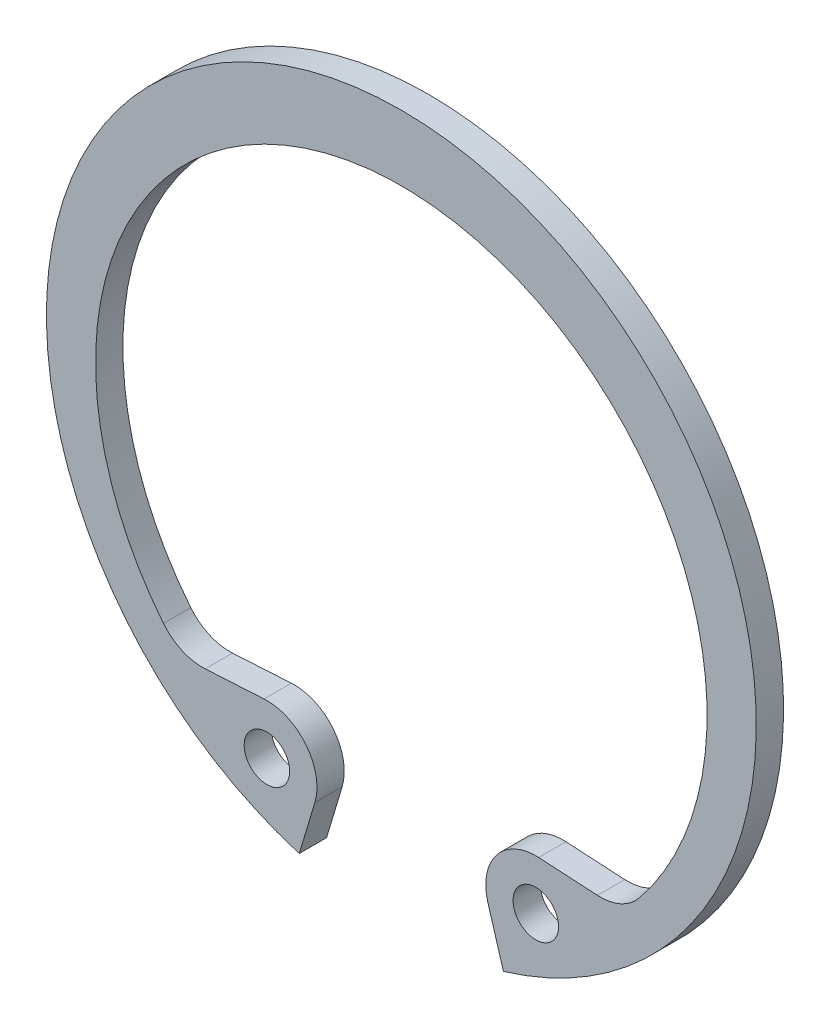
ISO-10303-21;
HEADER;
FILE_DESCRIPTION(('STEP AP214'),'2;1');
FILE_NAME('part.step','',(''),(''),'','','');
FILE_SCHEMA(('AUTOMOTIVE_DESIGN { 1 0 10303 214 1 1 1 1 }'));
ENDSEC;
DATA;
#1=APPLICATION_CONTEXT('core data for automotive mechanical design processes');
#2=APPLICATION_PROTOCOL_DEFINITION('international standard','automotive_design',2000,#1);
#3=PRODUCT_CONTEXT('',#1,'mechanical');
#4=PRODUCT('Part','Part','',(#3));
#5=PRODUCT_RELATED_PRODUCT_CATEGORY('part','',(#4));
#6=PRODUCT_DEFINITION_FORMATION('','',#4);
#7=PRODUCT_DEFINITION_CONTEXT('part definition',#1,'design');
#8=PRODUCT_DEFINITION('design','',#6,#7);
#9=PRODUCT_DEFINITION_SHAPE('','',#8);
#10=(LENGTH_UNIT() NAMED_UNIT(*) SI_UNIT(.MILLI.,.METRE.));
#11=(NAMED_UNIT(*) PLANE_ANGLE_UNIT() SI_UNIT($,.RADIAN.));
#12=(NAMED_UNIT(*) SI_UNIT($,.STERADIAN.) SOLID_ANGLE_UNIT());
#13=UNCERTAINTY_MEASURE_WITH_UNIT(LENGTH_MEASURE(1.E-05),#10,'distance_accuracy_value','');
#14=(GEOMETRIC_REPRESENTATION_CONTEXT(3) GLOBAL_UNCERTAINTY_ASSIGNED_CONTEXT((#13)) GLOBAL_UNIT_ASSIGNED_CONTEXT((#10,
#11,#12)) REPRESENTATION_CONTEXT('',''));
#15=CARTESIAN_POINT('',(0.,0.,0.));
#16=DIRECTION('',(0.,0.,1.));
#17=DIRECTION('',(1.,0.,0.));
#18=AXIS2_PLACEMENT_3D('',#15,#16,#17);
#19=CARTESIAN_POINT('',(0.,0.,1.5));
#20=DIRECTION('',(0.,0.,1.));
#21=DIRECTION('',(1.00000000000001,0.,0.));
#22=AXIS2_PLACEMENT_3D('',#19,#20,#21);
#23=PLANE('',#22);
#24=CARTESIAN_POINT('',(7.38669661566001,-15.0332702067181,1.5));
#25=DIRECTION('',(0.,0.,1.));
#26=DIRECTION('',(1.00000000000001,0.,0.));
#27=AXIS2_PLACEMENT_3D('',#24,#25,#26);
#28=CIRCLE('',#27,1.25);
#29=CARTESIAN_POINT('',(8.63669661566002,-15.0332702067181,1.5));
#30=VERTEX_POINT('',#29);
#31=EDGE_CURVE('E127',#30,#30,#28,.T.);
#32=ORIENTED_EDGE('',*,*,#31,.F.);
#33=EDGE_LOOP('',(#32));
#34=FACE_BOUND('',#33,.T.);
#35=CARTESIAN_POINT('',(0.,0.,1.5));
#36=DIRECTION('',(0.,0.,1.));
#37=DIRECTION('',(1.00000000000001,0.,0.));
#38=AXIS2_PLACEMENT_3D('',#35,#36,#37);
#39=CIRCLE('',#38,19.5);
#40=CARTESIAN_POINT('',(5.60938086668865,-18.6757823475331,1.5));
#41=VERTEX_POINT('',#40);
#42=CARTESIAN_POINT('',(-5.60938086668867,-18.6757823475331,1.5));
#43=VERTEX_POINT('',#42);
#44=EDGE_CURVE('E149',#41,#43,#39,.T.);
#45=ORIENTED_EDGE('',*,*,#44,.T.);
#46=DIRECTION('',(0.287660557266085,0.957732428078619,0.));
#47=VECTOR('',#46,1.);
#48=CARTESIAN_POINT('',(-4.75293243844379,-15.8243367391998,1.5));
#49=LINE('',#48,#47);
#50=CARTESIAN_POINT('',(-4.75293243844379,-15.8243367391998,1.5));
#51=VERTEX_POINT('',#50);
#52=EDGE_CURVE('E122',#43,#51,#49,.T.);
#53=ORIENTED_EDGE('',*,*,#52,.T.);
#54=CARTESIAN_POINT('',(-7.38669661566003,-15.0332702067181,1.5));
#55=DIRECTION('',(0.,0.,1.));
#56=DIRECTION('',(-1.00000000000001,0.,0.));
#57=AXIS2_PLACEMENT_3D('',#54,#55,#56);
#58=CIRCLE('',#57,2.75);
#59=CARTESIAN_POINT('',(-7.54413763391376,-12.2877807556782,1.5));
#60=VERTEX_POINT('',#59);
#61=EDGE_CURVE('E152',#51,#60,#58,.T.);
#62=ORIENTED_EDGE('',*,*,#61,.T.);
#63=DIRECTION('',(-0.998359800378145,-0.057251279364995,0.));
#64=VECTOR('',#63,1.);
#65=CARTESIAN_POINT('',(-10.7731774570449,-12.4729511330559,1.5));
#66=LINE('',#65,#64);
#67=CARTESIAN_POINT('',(-10.7731774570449,-12.4729511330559,1.5));
#68=VERTEX_POINT('',#67);
#69=EDGE_CURVE('E154',#60,#68,#66,.T.);
#70=ORIENTED_EDGE('',*,*,#69,.T.);
#71=CARTESIAN_POINT('',(-10.9306184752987,-9.72746168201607,1.5));
#72=DIRECTION('',(0.,0.,-1.));
#73=DIRECTION('',(-1.00000000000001,0.,0.));
#74=AXIS2_PLACEMENT_3D('',#71,#72,#73);
#75=CIRCLE('',#74,2.75);
#76=CARTESIAN_POINT('',(-13.0700633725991,-11.455256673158,1.5));
#77=VERTEX_POINT('',#76);
#78=EDGE_CURVE('E156',#68,#77,#75,.T.);
#79=ORIENTED_EDGE('',*,*,#78,.T.);
#80=CARTESIAN_POINT('',(0.,-0.899999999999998,1.5));
#81=DIRECTION('',(0.,0.,-1.));
#82=DIRECTION('',(1.00000000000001,0.,0.));
#83=AXIS2_PLACEMENT_3D('',#80,#81,#82);
#84=CIRCLE('',#83,16.8);
#85=CARTESIAN_POINT('',(13.0700633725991,-11.455256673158,1.5));
#86=VERTEX_POINT('',#85);
#87=EDGE_CURVE('E158',#77,#86,#84,.T.);
#88=ORIENTED_EDGE('',*,*,#87,.T.);
#89=CARTESIAN_POINT('',(10.9306184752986,-9.72746168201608,1.5));
#90=DIRECTION('',(0.,0.,-1.));
#91=DIRECTION('',(1.00000000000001,0.,0.));
#92=AXIS2_PLACEMENT_3D('',#89,#90,#91);
#93=CIRCLE('',#92,2.75);
#94=CARTESIAN_POINT('',(10.7731774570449,-12.472951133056,1.5));
#95=VERTEX_POINT('',#94);
#96=EDGE_CURVE('E160',#86,#95,#93,.T.);
#97=ORIENTED_EDGE('',*,*,#96,.T.);
#98=DIRECTION('',(-0.998359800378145,0.0572512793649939,0.));
#99=VECTOR('',#98,1.);
#100=CARTESIAN_POINT('',(10.7731774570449,-12.472951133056,1.5));
#101=LINE('',#100,#99);
#102=CARTESIAN_POINT('',(7.54413763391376,-12.2877807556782,1.5));
#103=VERTEX_POINT('',#102);
#104=EDGE_CURVE('E162',#95,#103,#101,.T.);
#105=ORIENTED_EDGE('',*,*,#104,.T.);
#106=CARTESIAN_POINT('',(7.38669661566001,-15.0332702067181,1.5));
#107=DIRECTION('',(0.,0.,1.));
#108=DIRECTION('',(1.00000000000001,0.,0.));
#109=AXIS2_PLACEMENT_3D('',#106,#107,#108);
#110=CIRCLE('',#109,2.75);
#111=CARTESIAN_POINT('',(4.75293243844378,-15.8243367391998,1.5));
#112=VERTEX_POINT('',#111);
#113=EDGE_CURVE('E51',#103,#112,#110,.T.);
#114=ORIENTED_EDGE('',*,*,#113,.T.);
#115=DIRECTION('',(0.287660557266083,-0.957732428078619,0.));
#116=VECTOR('',#115,1.);
#117=CARTESIAN_POINT('',(4.75293243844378,-15.8243367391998,1.5));
#118=LINE('',#117,#116);
#119=EDGE_CURVE('E46',#112,#41,#118,.T.);
#120=ORIENTED_EDGE('',*,*,#119,.T.);
#121=EDGE_LOOP('',(#45,#53,#62,#70,#79,#88,#97,#105,#114,#120));
#122=FACE_BOUND('',#121,.T.);
#123=CARTESIAN_POINT('',(-7.38669661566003,-15.0332702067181,1.5));
#124=DIRECTION('',(0.,0.,1.));
#125=DIRECTION('',(-1.00000000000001,0.,0.));
#126=AXIS2_PLACEMENT_3D('',#123,#124,#125);
#127=CIRCLE('',#126,1.25);
#128=CARTESIAN_POINT('',(-8.63669661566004,-15.0332702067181,1.5));
#129=VERTEX_POINT('',#128);
#130=EDGE_CURVE('E249',#129,#129,#127,.T.);
#131=ORIENTED_EDGE('',*,*,#130,.F.);
#132=EDGE_LOOP('',(#131));
#133=FACE_BOUND('',#132,.T.);
#134=ADVANCED_FACE('F31',(#34,#122,#133),#23,.T.);
#135=CARTESIAN_POINT('',(0.,0.,0.));
#136=DIRECTION('',(0.,0.,1.));
#137=DIRECTION('',(1.00000000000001,0.,0.));
#138=AXIS2_PLACEMENT_3D('',#135,#136,#137);
#139=PLANE('',#138);
#140=CARTESIAN_POINT('',(7.38669661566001,-15.0332702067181,0.));
#141=DIRECTION('',(0.,0.,1.));
#142=DIRECTION('',(1.00000000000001,0.,0.));
#143=AXIS2_PLACEMENT_3D('',#140,#141,#142);
#144=CIRCLE('',#143,1.25);
#145=CARTESIAN_POINT('',(8.63669661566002,-15.0332702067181,0.));
#146=VERTEX_POINT('',#145);
#147=EDGE_CURVE('E130',#146,#146,#144,.T.);
#148=ORIENTED_EDGE('',*,*,#147,.T.);
#149=EDGE_LOOP('',(#148));
#150=FACE_BOUND('',#149,.T.);
#151=CARTESIAN_POINT('',(0.,0.,0.));
#152=DIRECTION('',(0.,0.,1.));
#153=DIRECTION('',(1.00000000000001,0.,0.));
#154=AXIS2_PLACEMENT_3D('',#151,#152,#153);
#155=CIRCLE('',#154,19.5);
#156=CARTESIAN_POINT('',(5.60938086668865,-18.6757823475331,0.));
#157=VERTEX_POINT('',#156);
#158=CARTESIAN_POINT('',(-5.60938086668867,-18.6757823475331,0.));
#159=VERTEX_POINT('',#158);
#160=EDGE_CURVE('E113',#157,#159,#155,.T.);
#161=ORIENTED_EDGE('',*,*,#160,.F.);
#162=DIRECTION('',(0.287660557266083,-0.957732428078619,0.));
#163=VECTOR('',#162,1.);
#164=CARTESIAN_POINT('',(4.75293243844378,-15.8243367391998,0.));
#165=LINE('',#164,#163);
#166=CARTESIAN_POINT('',(4.75293243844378,-15.8243367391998,0.));
#167=VERTEX_POINT('',#166);
#168=EDGE_CURVE('E147',#167,#157,#165,.T.);
#169=ORIENTED_EDGE('',*,*,#168,.F.);
#170=CARTESIAN_POINT('',(7.38669661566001,-15.0332702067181,0.));
#171=DIRECTION('',(0.,0.,1.));
#172=DIRECTION('',(1.00000000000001,0.,0.));
#173=AXIS2_PLACEMENT_3D('',#170,#171,#172);
#174=CIRCLE('',#173,2.75);
#175=CARTESIAN_POINT('',(7.54413763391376,-12.2877807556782,0.));
#176=VERTEX_POINT('',#175);
#177=EDGE_CURVE('E145',#176,#167,#174,.T.);
#178=ORIENTED_EDGE('',*,*,#177,.F.);
#179=DIRECTION('',(-0.998359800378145,0.0572512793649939,0.));
#180=VECTOR('',#179,1.);
#181=CARTESIAN_POINT('',(10.7731774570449,-12.472951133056,0.));
#182=LINE('',#181,#180);
#183=CARTESIAN_POINT('',(10.7731774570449,-12.472951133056,0.));
#184=VERTEX_POINT('',#183);
#185=EDGE_CURVE('E143',#184,#176,#182,.T.);
#186=ORIENTED_EDGE('',*,*,#185,.F.);
#187=CARTESIAN_POINT('',(10.9306184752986,-9.72746168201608,0.));
#188=DIRECTION('',(0.,0.,-1.));
#189=DIRECTION('',(1.00000000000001,0.,0.));
#190=AXIS2_PLACEMENT_3D('',#187,#188,#189);
#191=CIRCLE('',#190,2.75);
#192=CARTESIAN_POINT('',(13.0700633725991,-11.455256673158,0.));
#193=VERTEX_POINT('',#192);
#194=EDGE_CURVE('E141',#193,#184,#191,.T.);
#195=ORIENTED_EDGE('',*,*,#194,.F.);
#196=CARTESIAN_POINT('',(0.,-0.899999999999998,0.));
#197=DIRECTION('',(0.,0.,-1.));
#198=DIRECTION('',(1.00000000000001,0.,0.));
#199=AXIS2_PLACEMENT_3D('',#196,#197,#198);
#200=CIRCLE('',#199,16.8);
#201=CARTESIAN_POINT('',(-13.0700633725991,-11.455256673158,0.));
#202=VERTEX_POINT('',#201);
#203=EDGE_CURVE('E139',#202,#193,#200,.T.);
#204=ORIENTED_EDGE('',*,*,#203,.F.);
#205=CARTESIAN_POINT('',(-10.9306184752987,-9.72746168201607,0.));
#206=DIRECTION('',(0.,0.,-1.));
#207=DIRECTION('',(-1.00000000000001,0.,0.));
#208=AXIS2_PLACEMENT_3D('',#205,#206,#207);
#209=CIRCLE('',#208,2.75);
#210=CARTESIAN_POINT('',(-10.7731774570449,-12.4729511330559,0.));
#211=VERTEX_POINT('',#210);
#212=EDGE_CURVE('E137',#211,#202,#209,.T.);
#213=ORIENTED_EDGE('',*,*,#212,.F.);
#214=DIRECTION('',(-0.998359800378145,-0.057251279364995,0.));
#215=VECTOR('',#214,1.);
#216=CARTESIAN_POINT('',(-10.7731774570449,-12.4729511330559,0.));
#217=LINE('',#216,#215);
#218=CARTESIAN_POINT('',(-7.54413763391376,-12.2877807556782,0.));
#219=VERTEX_POINT('',#218);
#220=EDGE_CURVE('E135',#219,#211,#217,.T.);
#221=ORIENTED_EDGE('',*,*,#220,.F.);
#222=CARTESIAN_POINT('',(-7.38669661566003,-15.0332702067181,0.));
#223=DIRECTION('',(0.,0.,1.));
#224=DIRECTION('',(-1.00000000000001,0.,0.));
#225=AXIS2_PLACEMENT_3D('',#222,#223,#224);
#226=CIRCLE('',#225,2.75);
#227=CARTESIAN_POINT('',(-4.75293243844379,-15.8243367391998,0.));
#228=VERTEX_POINT('',#227);
#229=EDGE_CURVE('E115',#228,#219,#226,.T.);
#230=ORIENTED_EDGE('',*,*,#229,.F.);
#231=DIRECTION('',(0.287660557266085,0.957732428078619,0.));
#232=VECTOR('',#231,1.);
#233=CARTESIAN_POINT('',(-4.75293243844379,-15.8243367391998,0.));
#234=LINE('',#233,#232);
#235=EDGE_CURVE('E108',#159,#228,#234,.T.);
#236=ORIENTED_EDGE('',*,*,#235,.F.);
#237=EDGE_LOOP('',(#161,#169,#178,#186,#195,#204,#213,#221,#230,#236));
#238=FACE_BOUND('',#237,.T.);
#239=CARTESIAN_POINT('',(-7.38669661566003,-15.0332702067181,0.));
#240=DIRECTION('',(0.,0.,1.));
#241=DIRECTION('',(-1.00000000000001,0.,0.));
#242=AXIS2_PLACEMENT_3D('',#239,#240,#241);
#243=CIRCLE('',#242,1.25);
#244=CARTESIAN_POINT('',(-8.63669661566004,-15.0332702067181,0.));
#245=VERTEX_POINT('',#244);
#246=EDGE_CURVE('E252',#245,#245,#243,.T.);
#247=ORIENTED_EDGE('',*,*,#246,.T.);
#248=EDGE_LOOP('',(#247));
#249=FACE_BOUND('',#248,.T.);
#250=ADVANCED_FACE('F109',(#150,#238,#249),#139,.F.);
#251=CARTESIAN_POINT('',(0.,0.,1.5));
#252=DIRECTION('',(0.,0.,-1.));
#253=DIRECTION('',(-1.00000000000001,0.,0.));
#254=AXIS2_PLACEMENT_3D('',#251,#252,#253);
#255=CYLINDRICAL_SURFACE('',#254,19.5);
#256=ORIENTED_EDGE('',*,*,#160,.T.);
#257=DIRECTION('',(0.,0.,-1.));
#258=VECTOR('',#257,1.);
#259=CARTESIAN_POINT('',(-5.60938086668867,-18.6757823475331,1.5));
#260=LINE('',#259,#258);
#261=EDGE_CURVE('E11',#43,#159,#260,.T.);
#262=ORIENTED_EDGE('',*,*,#261,.F.);
#263=ORIENTED_EDGE('',*,*,#44,.F.);
#264=DIRECTION('',(0.,0.,-1.));
#265=VECTOR('',#264,1.);
#266=CARTESIAN_POINT('',(5.60938086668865,-18.6757823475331,1.5));
#267=LINE('',#266,#265);
#268=EDGE_CURVE('E126',#41,#157,#267,.T.);
#269=ORIENTED_EDGE('',*,*,#268,.T.);
#270=EDGE_LOOP('',(#256,#262,#263,#269));
#271=FACE_BOUND('',#270,.T.);
#272=ADVANCED_FACE('F33',(#271),#255,.T.);
#273=CARTESIAN_POINT('',(-4.75293243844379,-15.8243367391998,1.5));
#274=DIRECTION('',(-0.957732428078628,0.287660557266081,0.));
#275=DIRECTION('',(-0.287660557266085,-0.957732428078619,0.));
#276=AXIS2_PLACEMENT_3D('',#273,#274,#275);
#277=PLANE('',#276);
#278=ORIENTED_EDGE('',*,*,#235,.T.);
#279=DIRECTION('',(0.,0.,-1.));
#280=VECTOR('',#279,1.);
#281=CARTESIAN_POINT('',(-4.75293243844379,-15.8243367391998,1.5));
#282=LINE('',#281,#280);
#283=EDGE_CURVE('E39',#51,#228,#282,.T.);
#284=ORIENTED_EDGE('',*,*,#283,.F.);
#285=ORIENTED_EDGE('',*,*,#52,.F.);
#286=ORIENTED_EDGE('',*,*,#261,.T.);
#287=EDGE_LOOP('',(#278,#284,#285,#286));
#288=FACE_BOUND('',#287,.T.);
#289=ADVANCED_FACE('F121',(#288),#277,.F.);
#290=CARTESIAN_POINT('',(-7.38669661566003,-15.0332702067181,1.5));
#291=DIRECTION('',(0.,0.,-1.));
#292=DIRECTION('',(-1.00000000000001,0.,0.));
#293=AXIS2_PLACEMENT_3D('',#290,#291,#292);
#294=CYLINDRICAL_SURFACE('',#293,2.75);
#295=ORIENTED_EDGE('',*,*,#229,.T.);
#296=DIRECTION('',(0.,0.,-1.));
#297=VECTOR('',#296,1.);
#298=CARTESIAN_POINT('',(-7.54413763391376,-12.2877807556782,1.5));
#299=LINE('',#298,#297);
#300=EDGE_CURVE('E185',#60,#219,#299,.T.);
#301=ORIENTED_EDGE('',*,*,#300,.F.);
#302=ORIENTED_EDGE('',*,*,#61,.F.);
#303=ORIENTED_EDGE('',*,*,#283,.T.);
#304=EDGE_LOOP('',(#295,#301,#302,#303));
#305=FACE_BOUND('',#304,.T.);
#306=ADVANCED_FACE('F189',(#305),#294,.T.);
#307=CARTESIAN_POINT('',(-10.7731774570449,-12.4729511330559,1.5));
#308=DIRECTION('',(0.0572512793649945,-0.998359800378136,0.));
#309=DIRECTION('',(0.998359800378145,0.057251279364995,0.));
#310=AXIS2_PLACEMENT_3D('',#307,#308,#309);
#311=PLANE('',#310);
#312=ORIENTED_EDGE('',*,*,#220,.T.);
#313=DIRECTION('',(0.,0.,-1.));
#314=VECTOR('',#313,1.);
#315=CARTESIAN_POINT('',(-10.7731774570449,-12.4729511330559,1.5));
#316=LINE('',#315,#314);
#317=EDGE_CURVE('E182',#68,#211,#316,.T.);
#318=ORIENTED_EDGE('',*,*,#317,.F.);
#319=ORIENTED_EDGE('',*,*,#69,.F.);
#320=ORIENTED_EDGE('',*,*,#300,.T.);
#321=EDGE_LOOP('',(#312,#318,#319,#320));
#322=FACE_BOUND('',#321,.T.);
#323=ADVANCED_FACE('F197',(#322),#311,.F.);
#324=CARTESIAN_POINT('',(-10.9306184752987,-9.72746168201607,1.5));
#325=DIRECTION('',(0.,0.,-1.));
#326=DIRECTION('',(-1.00000000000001,0.,0.));
#327=AXIS2_PLACEMENT_3D('',#324,#325,#326);
#328=CYLINDRICAL_SURFACE('',#327,2.75);
#329=ORIENTED_EDGE('',*,*,#212,.T.);
#330=DIRECTION('',(0.,0.,-1.));
#331=VECTOR('',#330,1.);
#332=CARTESIAN_POINT('',(-13.0700633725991,-11.455256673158,1.5));
#333=LINE('',#332,#331);
#334=EDGE_CURVE('E179',#77,#202,#333,.T.);
#335=ORIENTED_EDGE('',*,*,#334,.F.);
#336=ORIENTED_EDGE('',*,*,#78,.F.);
#337=ORIENTED_EDGE('',*,*,#317,.T.);
#338=EDGE_LOOP('',(#329,#335,#336,#337));
#339=FACE_BOUND('',#338,.T.);
#340=ADVANCED_FACE('F200',(#339),#328,.F.);
#341=CARTESIAN_POINT('',(0.,-0.899999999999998,1.5));
#342=DIRECTION('',(0.,0.,-1.));
#343=DIRECTION('',(-1.00000000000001,0.,0.));
#344=AXIS2_PLACEMENT_3D('',#341,#342,#343);
#345=CYLINDRICAL_SURFACE('',#344,16.8);
#346=ORIENTED_EDGE('',*,*,#203,.T.);
#347=DIRECTION('',(0.,0.,-1.));
#348=VECTOR('',#347,1.);
#349=CARTESIAN_POINT('',(13.0700633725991,-11.455256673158,1.5));
#350=LINE('',#349,#348);
#351=EDGE_CURVE('E176',#86,#193,#350,.T.);
#352=ORIENTED_EDGE('',*,*,#351,.F.);
#353=ORIENTED_EDGE('',*,*,#87,.F.);
#354=ORIENTED_EDGE('',*,*,#334,.T.);
#355=EDGE_LOOP('',(#346,#352,#353,#354));
#356=FACE_BOUND('',#355,.T.);
#357=ADVANCED_FACE('F205',(#356),#345,.F.);
#358=CARTESIAN_POINT('',(10.9306184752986,-9.72746168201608,1.5));
#359=DIRECTION('',(0.,0.,-1.));
#360=DIRECTION('',(-1.00000000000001,0.,0.));
#361=AXIS2_PLACEMENT_3D('',#358,#359,#360);
#362=CYLINDRICAL_SURFACE('',#361,2.75);
#363=ORIENTED_EDGE('',*,*,#194,.T.);
#364=DIRECTION('',(0.,0.,-1.));
#365=VECTOR('',#364,1.);
#366=CARTESIAN_POINT('',(10.7731774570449,-12.472951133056,1.5));
#367=LINE('',#366,#365);
#368=EDGE_CURVE('E173',#95,#184,#367,.T.);
#369=ORIENTED_EDGE('',*,*,#368,.F.);
#370=ORIENTED_EDGE('',*,*,#96,.F.);
#371=ORIENTED_EDGE('',*,*,#351,.T.);
#372=EDGE_LOOP('',(#363,#369,#370,#371));
#373=FACE_BOUND('',#372,.T.);
#374=ADVANCED_FACE('F211',(#373),#362,.F.);
#375=CARTESIAN_POINT('',(10.7731774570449,-12.472951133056,1.5));
#376=DIRECTION('',(-0.0572512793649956,-0.998359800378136,0.));
#377=DIRECTION('',(0.998359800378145,-0.0572512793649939,0.));
#378=AXIS2_PLACEMENT_3D('',#375,#376,#377);
#379=PLANE('',#378);
#380=ORIENTED_EDGE('',*,*,#185,.T.);
#381=DIRECTION('',(0.,0.,-1.));
#382=VECTOR('',#381,1.);
#383=CARTESIAN_POINT('',(7.54413763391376,-12.2877807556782,1.5));
#384=LINE('',#383,#382);
#385=EDGE_CURVE('E170',#103,#176,#384,.T.);
#386=ORIENTED_EDGE('',*,*,#385,.F.);
#387=ORIENTED_EDGE('',*,*,#104,.F.);
#388=ORIENTED_EDGE('',*,*,#368,.T.);
#389=EDGE_LOOP('',(#380,#386,#387,#388));
#390=FACE_BOUND('',#389,.T.);
#391=ADVANCED_FACE('F215',(#390),#379,.F.);
#392=CARTESIAN_POINT('',(7.38669661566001,-15.0332702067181,1.5));
#393=DIRECTION('',(0.,0.,-1.));
#394=DIRECTION('',(-1.00000000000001,0.,0.));
#395=AXIS2_PLACEMENT_3D('',#392,#393,#394);
#396=CYLINDRICAL_SURFACE('',#395,2.75);
#397=ORIENTED_EDGE('',*,*,#177,.T.);
#398=DIRECTION('',(0.,0.,-1.));
#399=VECTOR('',#398,1.);
#400=CARTESIAN_POINT('',(4.75293243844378,-15.8243367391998,1.5));
#401=LINE('',#400,#399);
#402=EDGE_CURVE('E167',#112,#167,#401,.T.);
#403=ORIENTED_EDGE('',*,*,#402,.F.);
#404=ORIENTED_EDGE('',*,*,#113,.F.);
#405=ORIENTED_EDGE('',*,*,#385,.T.);
#406=EDGE_LOOP('',(#397,#403,#404,#405));
#407=FACE_BOUND('',#406,.T.);
#408=ADVANCED_FACE('F218',(#407),#396,.T.);
#409=CARTESIAN_POINT('',(4.75293243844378,-15.8243367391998,1.5));
#410=DIRECTION('',(0.957732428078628,0.287660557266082,0.));
#411=DIRECTION('',(-0.287660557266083,0.957732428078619,0.));
#412=AXIS2_PLACEMENT_3D('',#409,#410,#411);
#413=PLANE('',#412);
#414=ORIENTED_EDGE('',*,*,#168,.T.);
#415=ORIENTED_EDGE('',*,*,#268,.F.);
#416=ORIENTED_EDGE('',*,*,#119,.F.);
#417=ORIENTED_EDGE('',*,*,#402,.T.);
#418=EDGE_LOOP('',(#414,#415,#416,#417));
#419=FACE_BOUND('',#418,.T.);
#420=ADVANCED_FACE('F220',(#419),#413,.F.);
#421=CARTESIAN_POINT('',(7.38669661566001,-15.0332702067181,1.5));
#422=DIRECTION('',(0.,0.,-1.));
#423=DIRECTION('',(-1.00000000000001,0.,0.));
#424=AXIS2_PLACEMENT_3D('',#421,#422,#423);
#425=CYLINDRICAL_SURFACE('',#424,1.25);
#426=ORIENTED_EDGE('',*,*,#31,.T.);
#427=EDGE_LOOP('',(#426));
#428=FACE_BOUND('',#427,.T.);
#429=ORIENTED_EDGE('',*,*,#147,.F.);
#430=EDGE_LOOP('',(#429));
#431=FACE_BOUND('',#430,.T.);
#432=ADVANCED_FACE('F222',(#428,#431),#425,.F.);
#433=CARTESIAN_POINT('',(-7.38669661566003,-15.0332702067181,1.5));
#434=DIRECTION('',(0.,0.,-1.));
#435=DIRECTION('',(-1.00000000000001,0.,0.));
#436=AXIS2_PLACEMENT_3D('',#433,#434,#435);
#437=CYLINDRICAL_SURFACE('',#436,1.25);
#438=ORIENTED_EDGE('',*,*,#130,.T.);
#439=EDGE_LOOP('',(#438));
#440=FACE_BOUND('',#439,.T.);
#441=ORIENTED_EDGE('',*,*,#246,.F.);
#442=EDGE_LOOP('',(#441));
#443=FACE_BOUND('',#442,.T.);
#444=ADVANCED_FACE('F228',(#440,#443),#437,.F.);
#445=CLOSED_SHELL('',(#134,#250,#272,#289,#306,#323,#340,#357,#374,#391,#408,#420,#432,#444));
#446=MANIFOLD_SOLID_BREP('B2',#445);
#447=ADVANCED_BREP_SHAPE_REPRESENTATION('',(#18,#446),#14);
#448=SHAPE_DEFINITION_REPRESENTATION(#9,#447);
ENDSEC;
END-ISO-10303-21;
